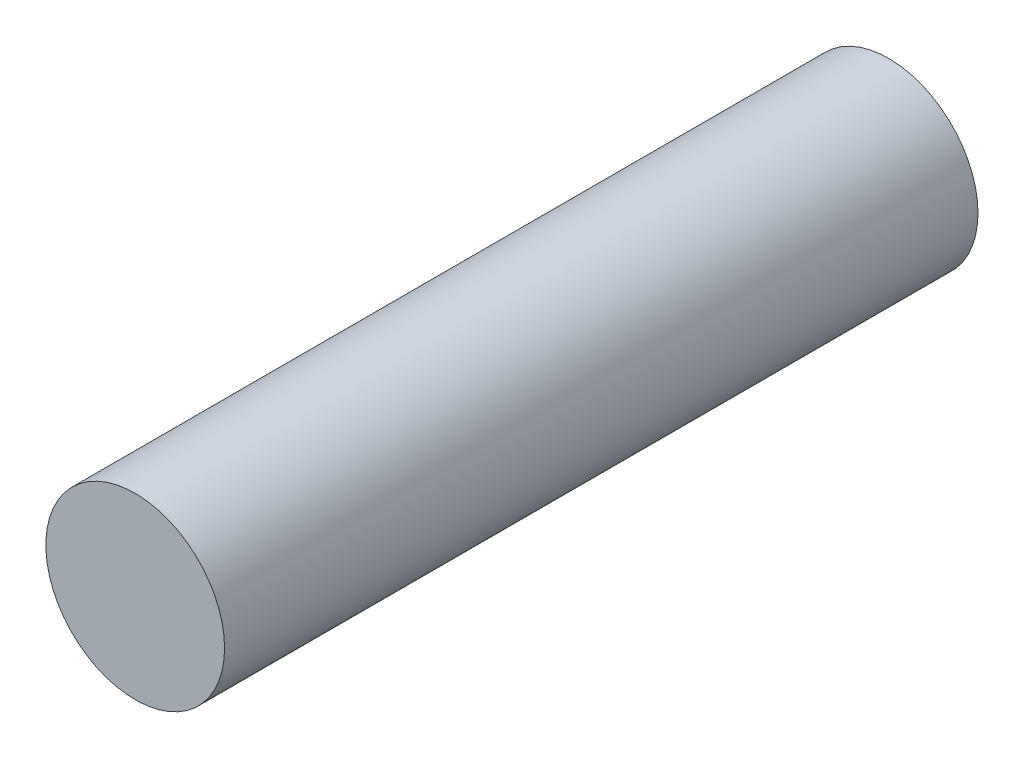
ISO-10303-21;
HEADER;
FILE_DESCRIPTION(('STEP AP214'),'2;1');
FILE_NAME('part.step','',(''),(''),'','','');
FILE_SCHEMA(('AUTOMOTIVE_DESIGN { 1 0 10303 214 1 1 1 1 }'));
ENDSEC;
DATA;
#1=APPLICATION_CONTEXT('core data for automotive mechanical design processes');
#2=APPLICATION_PROTOCOL_DEFINITION('international standard','automotive_design',2000,#1);
#3=PRODUCT_CONTEXT('',#1,'mechanical');
#4=PRODUCT('Part','Part','',(#3));
#5=PRODUCT_RELATED_PRODUCT_CATEGORY('part','',(#4));
#6=PRODUCT_DEFINITION_FORMATION('','',#4);
#7=PRODUCT_DEFINITION_CONTEXT('part definition',#1,'design');
#8=PRODUCT_DEFINITION('design','',#6,#7);
#9=PRODUCT_DEFINITION_SHAPE('','',#8);
#10=(LENGTH_UNIT() NAMED_UNIT(*) SI_UNIT(.MILLI.,.METRE.));
#11=(NAMED_UNIT(*) PLANE_ANGLE_UNIT() SI_UNIT($,.RADIAN.));
#12=(NAMED_UNIT(*) SI_UNIT($,.STERADIAN.) SOLID_ANGLE_UNIT());
#13=UNCERTAINTY_MEASURE_WITH_UNIT(LENGTH_MEASURE(1.E-05),#10,'distance_accuracy_value','');
#14=(GEOMETRIC_REPRESENTATION_CONTEXT(3) GLOBAL_UNCERTAINTY_ASSIGNED_CONTEXT((#13)) GLOBAL_UNIT_ASSIGNED_CONTEXT((#10,
#11,#12)) REPRESENTATION_CONTEXT('',''));
#15=CARTESIAN_POINT('',(0.,0.,0.));
#16=DIRECTION('',(0.,0.,1.));
#17=DIRECTION('',(1.,0.,0.));
#18=AXIS2_PLACEMENT_3D('',#15,#16,#17);
#19=CARTESIAN_POINT('',(0.,0.,5.461));
#20=DIRECTION('',(0.,0.,-1.));
#21=DIRECTION('',(-1.,0.,0.));
#22=AXIS2_PLACEMENT_3D('',#19,#20,#21);
#23=CYLINDRICAL_SURFACE('',#22,0.6477);
#24=CARTESIAN_POINT('',(0.,0.,5.461));
#25=DIRECTION('',(0.,0.,1.));
#26=DIRECTION('',(1.,0.,0.));
#27=AXIS2_PLACEMENT_3D('',#24,#25,#26);
#28=CIRCLE('',#27,0.6477);
#29=CARTESIAN_POINT('',(0.6477,0.,5.461));
#30=VERTEX_POINT('',#29);
#31=EDGE_CURVE('E10',#30,#30,#28,.T.);
#32=ORIENTED_EDGE('',*,*,#31,.F.);
#33=EDGE_LOOP('',(#32));
#34=FACE_BOUND('',#33,.T.);
#35=CARTESIAN_POINT('',(0.,0.,0.));
#36=DIRECTION('',(0.,0.,1.));
#37=DIRECTION('',(1.,0.,0.));
#38=AXIS2_PLACEMENT_3D('',#35,#36,#37);
#39=CIRCLE('',#38,0.6477);
#40=CARTESIAN_POINT('',(0.6477,0.,0.));
#41=VERTEX_POINT('',#40);
#42=EDGE_CURVE('E33',#41,#41,#39,.T.);
#43=ORIENTED_EDGE('',*,*,#42,.T.);
#44=EDGE_LOOP('',(#43));
#45=FACE_BOUND('',#44,.T.);
#46=ADVANCED_FACE('F30',(#34,#45),#23,.T.);
#47=CARTESIAN_POINT('',(0.,0.,5.461));
#48=DIRECTION('',(0.,0.,1.));
#49=DIRECTION('',(1.,0.,0.));
#50=AXIS2_PLACEMENT_3D('',#47,#48,#49);
#51=PLANE('',#50);
#52=ORIENTED_EDGE('',*,*,#31,.T.);
#53=EDGE_LOOP('',(#52));
#54=FACE_BOUND('',#53,.T.);
#55=ADVANCED_FACE('F45',(#54),#51,.T.);
#56=CARTESIAN_POINT('',(0.,0.,0.));
#57=DIRECTION('',(0.,0.,1.));
#58=DIRECTION('',(1.,0.,0.));
#59=AXIS2_PLACEMENT_3D('',#56,#57,#58);
#60=PLANE('',#59);
#61=ORIENTED_EDGE('',*,*,#42,.F.);
#62=EDGE_LOOP('',(#61));
#63=FACE_BOUND('',#62,.T.);
#64=ADVANCED_FACE('F43',(#63),#60,.F.);
#65=CLOSED_SHELL('',(#46,#55,#64));
#66=MANIFOLD_SOLID_BREP('B2',#65);
#67=ADVANCED_BREP_SHAPE_REPRESENTATION('',(#18,#66),#14);
#68=SHAPE_DEFINITION_REPRESENTATION(#9,#67);
ENDSEC;
END-ISO-10303-21;
